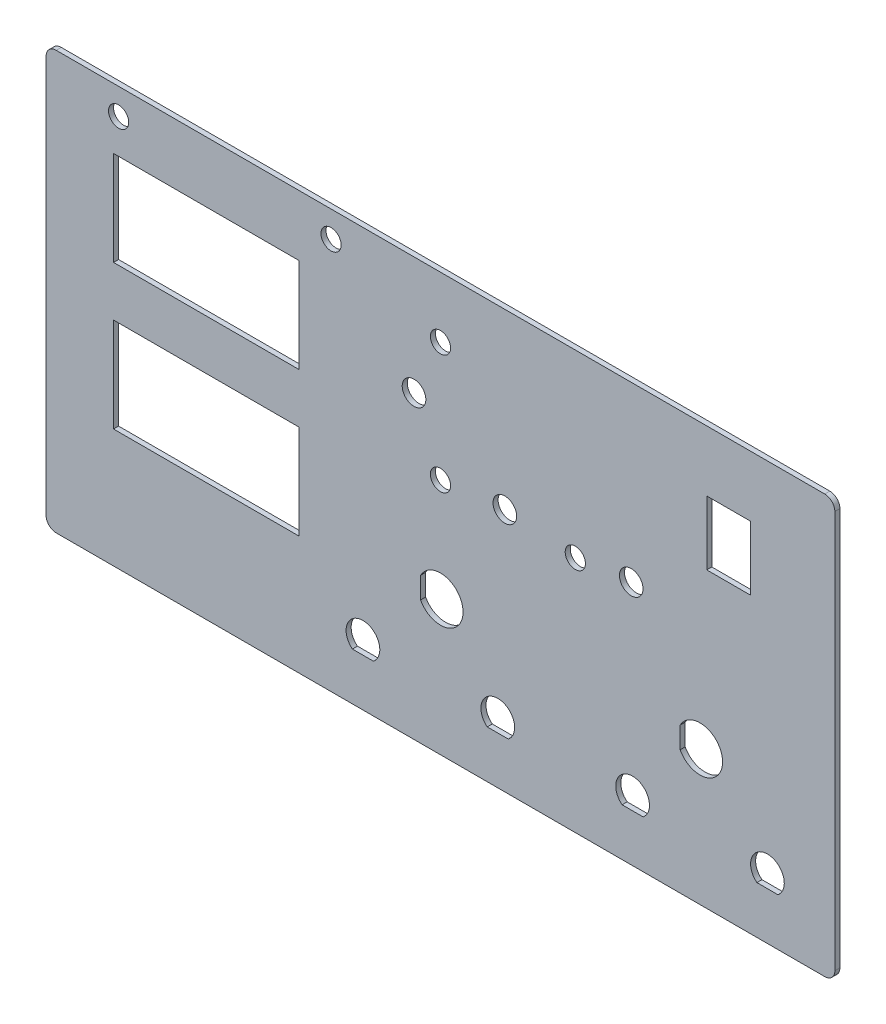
from build123d import *

# Parameters (mm, degrees)
SKICA1_R                 = 3
SKICA1_W                 = 55
SKICA1_H                 = 28
SKICA1_W_2               = 13
SKICA1_H_2               = 19
P_IDAT_VYSUNUT_M1_DEPTH  = 1.5
ODEBRAT_VYSUNUT_M1_REACH = 172.491
SKICA3_R                 = 3
SKICA3_R_2               = 3.5


with BuildPart() as part:
    # Skica1 → P_idat vysunut_m1 (new body)
    with BuildSketch(Plane.XY):
        with BuildLine():
            Line((-114, 124), (114, 124))
            ThreePointArc((114, 124), (116.121320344, 123.121320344), (117, 121))
            Line((117, 121), (117, 3))
            ThreePointArc((117, 3), (116.121320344, 0.878679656), (114, 0))
            Line((114, 0), (-114, 0))
            ThreePointArc((-114, 0), (-116.121320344, 0.878679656), (-117, 3))
            Line((-117, 3), (-117, 121))
            ThreePointArc((-117, 121), (-116.121320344, 123.121320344), (-114, 124))
        make_face()
        with Locations((0, 70.6)):
            Circle(SKICA1_R, mode=Mode.SUBTRACT)
        with Locations((40, 70.6)):
            Circle(SKICA1_R, mode=Mode.SUBTRACT)
        with Locations((0, 106)):
            Circle(SKICA1_R, mode=Mode.SUBTRACT)
        with Locations((-69.5, 92)):
            Rectangle(SKICA1_W, SKICA1_H, mode=Mode.SUBTRACT)
        with Locations((-69.5, 49.2)):
            Rectangle(SKICA1_W, SKICA1_H, mode=Mode.SUBTRACT)
        with Locations((85.5, 96.5)):
            Rectangle(SKICA1_W_2, SKICA1_H_2, mode=Mode.SUBTRACT)
        with BuildLine():
            Line((71.1, 43.174901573), (71.1, 36.825098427))
            ThreePointArc((71.1, 36.825098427), (83.7, 40), (71.1, 43.174901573))
        make_face(mode=Mode.SUBTRACT)
        with BuildLine():
            Line((-19.871102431, 14.1), (-26.128897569, 14.1))
            ThreePointArc((-26.128897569, 14.1), (-23, 23), (-19.871102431, 14.1))
        make_face(mode=Mode.SUBTRACT)
        with BuildLine():
            Line((-5.9, 43.174901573), (-5.9, 36.825098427))
            ThreePointArc((-5.9, 36.825098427), (6.7, 40), (-5.9, 43.174901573))
        make_face(mode=Mode.SUBTRACT)
        with BuildLine():
            Line((13.871102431, 14.1), (20.128897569, 14.1))
            ThreePointArc((20.128897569, 14.1), (17, 23), (13.871102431, 14.1))
        make_face(mode=Mode.SUBTRACT)
        with BuildLine():
            Line((53.871102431, 14.1), (60.128897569, 14.1))
            ThreePointArc((60.128897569, 14.1), (57, 23), (53.871102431, 14.1))
        make_face(mode=Mode.SUBTRACT)
        with BuildLine():
            Line((93.871102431, 14.1), (100.128897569, 14.1))
            ThreePointArc((100.128897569, 14.1), (97, 23), (93.871102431, 14.1))
        make_face(mode=Mode.SUBTRACT)
    extrude(amount=P_IDAT_VYSUNUT_M1_DEPTH)

    # Skica3 → Odebrat vysunut_m1 (cut, up to next)
    with BuildSketch(Plane.XY.offset(1.5), mode=Mode.PRIVATE) as odebrat_vysunut_m1_sk1:
        with Locations((-95.481706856, 116.236108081)):
            Circle(SKICA3_R)
    odebrat_vysunut_m1_tool1 = extrude(odebrat_vysunut_m1_sk1.sketch, amount=-ODEBRAT_VYSUNUT_M1_REACH, mode=Mode.PRIVATE) & part.part
    # Skica3 → Odebrat vysunut_m1 (cut, up to next)
    with BuildSketch(Plane.XY.offset(1.5), mode=Mode.PRIVATE) as odebrat_vysunut_m1_sk2:
        with Locations((-32.464159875, 116.2184119)):
            Circle(SKICA3_R)
    odebrat_vysunut_m1_tool2 = extrude(odebrat_vysunut_m1_sk2.sketch, amount=-ODEBRAT_VYSUNUT_M1_REACH, mode=Mode.PRIVATE) & part.part
    # Skica3 → Odebrat vysunut_m1 (cut, up to next)
    with BuildSketch(Plane.XY.offset(1.5), mode=Mode.PRIVATE) as odebrat_vysunut_m1_sk3:
        with Locations((-7.846225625, 89.080442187)):
            Circle(SKICA3_R_2)
    odebrat_vysunut_m1_tool3 = extrude(odebrat_vysunut_m1_sk3.sketch, amount=-ODEBRAT_VYSUNUT_M1_REACH, mode=Mode.PRIVATE) & part.part
    # Skica3 → Odebrat vysunut_m1 (cut, up to next)
    with BuildSketch(Plane.XY.offset(1.5), mode=Mode.PRIVATE) as odebrat_vysunut_m1_sk4:
        with Locations((19.095190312, 72.547744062)):
            Circle(SKICA3_R_2)
    odebrat_vysunut_m1_tool4 = extrude(odebrat_vysunut_m1_sk4.sketch, amount=-ODEBRAT_VYSUNUT_M1_REACH, mode=Mode.PRIVATE) & part.part
    # Skica3 → Odebrat vysunut_m1 (cut, up to next)
    with BuildSketch(Plane.XY.offset(1.5), mode=Mode.PRIVATE) as odebrat_vysunut_m1_sk5:
        with Locations((56.595073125, 72.641494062)):
            Circle(SKICA3_R_2)
    odebrat_vysunut_m1_tool5 = extrude(odebrat_vysunut_m1_sk5.sketch, amount=-ODEBRAT_VYSUNUT_M1_REACH, mode=Mode.PRIVATE) & part.part
    add(odebrat_vysunut_m1_tool1.solids().sort_by_distance((-95.481707, 116.236108, 1.5))[0], mode=Mode.SUBTRACT)
    add(odebrat_vysunut_m1_tool2.solids().sort_by_distance((-32.46416, 116.218412, 1.5))[0], mode=Mode.SUBTRACT)
    add(odebrat_vysunut_m1_tool3.solids().sort_by_distance((-7.846226, 89.080442, 1.5))[0], mode=Mode.SUBTRACT)
    add(odebrat_vysunut_m1_tool4.solids().sort_by_distance((19.09519, 72.547744, 1.5))[0], mode=Mode.SUBTRACT)
    add(odebrat_vysunut_m1_tool5.solids().sort_by_distance((56.595073, 72.641494, 1.5))[0], mode=Mode.SUBTRACT)


solid = part.part
